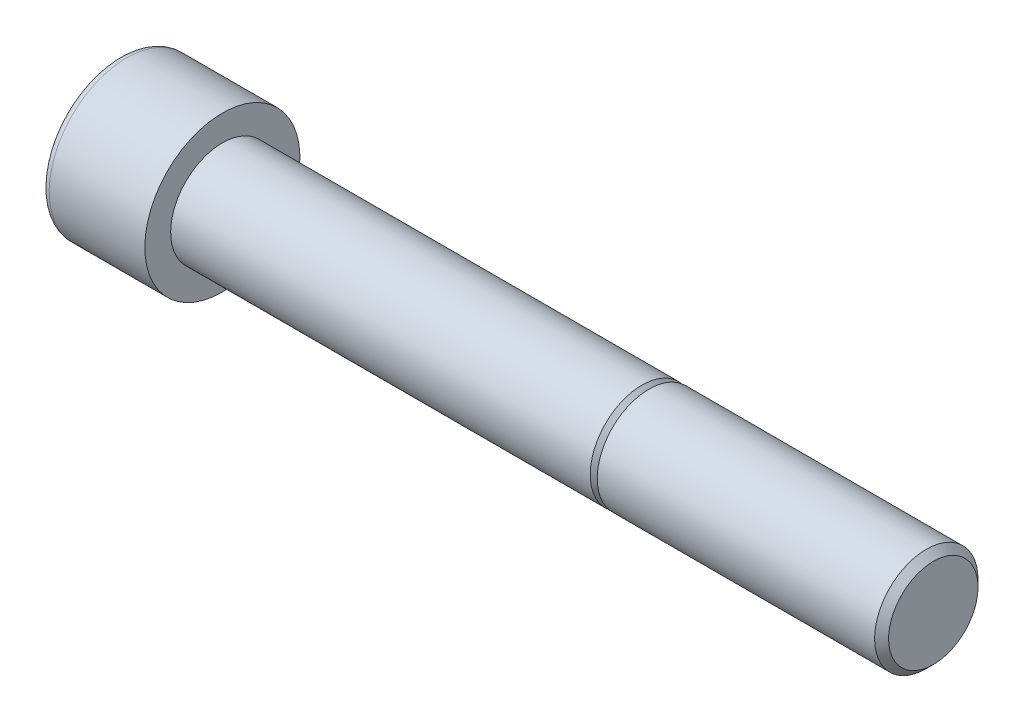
ISO-10303-21;
HEADER;
FILE_DESCRIPTION(('STEP AP214'),'2;1');
FILE_NAME('part.step','',(''),(''),'','','');
FILE_SCHEMA(('AUTOMOTIVE_DESIGN { 1 0 10303 214 1 1 1 1 }'));
ENDSEC;
DATA;
#1=APPLICATION_CONTEXT('core data for automotive mechanical design processes');
#2=APPLICATION_PROTOCOL_DEFINITION('international standard','automotive_design',2000,#1);
#3=PRODUCT_CONTEXT('',#1,'mechanical');
#4=PRODUCT('Part','Part','',(#3));
#5=PRODUCT_RELATED_PRODUCT_CATEGORY('part','',(#4));
#6=PRODUCT_DEFINITION_FORMATION('','',#4);
#7=PRODUCT_DEFINITION_CONTEXT('part definition',#1,'design');
#8=PRODUCT_DEFINITION('design','',#6,#7);
#9=PRODUCT_DEFINITION_SHAPE('','',#8);
#10=(LENGTH_UNIT() NAMED_UNIT(*) SI_UNIT(.MILLI.,.METRE.));
#11=(NAMED_UNIT(*) PLANE_ANGLE_UNIT() SI_UNIT($,.RADIAN.));
#12=(NAMED_UNIT(*) SI_UNIT($,.STERADIAN.) SOLID_ANGLE_UNIT());
#13=UNCERTAINTY_MEASURE_WITH_UNIT(LENGTH_MEASURE(1.E-05),#10,'distance_accuracy_value','');
#14=(GEOMETRIC_REPRESENTATION_CONTEXT(3) GLOBAL_UNCERTAINTY_ASSIGNED_CONTEXT((#13)) GLOBAL_UNIT_ASSIGNED_CONTEXT((#10,
#11,#12)) REPRESENTATION_CONTEXT('',''));
#15=CARTESIAN_POINT('',(0.,0.,0.));
#16=DIRECTION('',(0.,0.,1.));
#17=DIRECTION('',(1.,0.,0.));
#18=AXIS2_PLACEMENT_3D('',#15,#16,#17);
#19=CARTESIAN_POINT('',(80.,0.,0.));
#20=DIRECTION('',(-1.,0.,0.));
#21=DIRECTION('',(0.,-1.,0.));
#22=AXIS2_PLACEMENT_3D('',#19,#20,#21);
#23=CYLINDRICAL_SURFACE('',#22,8.);
#24=CARTESIAN_POINT('',(78.9175,0.,0.));
#25=DIRECTION('',(1.,0.,0.));
#26=DIRECTION('',(0.,1.,0.));
#27=AXIS2_PLACEMENT_3D('',#24,#25,#26);
#28=CIRCLE('',#27,8.);
#29=CARTESIAN_POINT('',(78.9175,8.,0.));
#30=VERTEX_POINT('',#29);
#31=EDGE_CURVE('E154',#30,#30,#28,.F.);
#32=ORIENTED_EDGE('',*,*,#31,.T.);
#33=EDGE_LOOP('',(#32));
#34=FACE_BOUND('',#33,.T.);
#35=CARTESIAN_POINT('',(36.,0.,0.));
#36=DIRECTION('',(-1.,0.,0.));
#37=DIRECTION('',(0.,-1.,0.));
#38=AXIS2_PLACEMENT_3D('',#35,#36,#37);
#39=CIRCLE('',#38,8.);
#40=CARTESIAN_POINT('',(36.,-8.,0.));
#41=VERTEX_POINT('',#40);
#42=EDGE_CURVE('E134',#41,#41,#39,.T.);
#43=ORIENTED_EDGE('',*,*,#42,.F.);
#44=EDGE_LOOP('',(#43));
#45=FACE_BOUND('',#44,.T.);
#46=ADVANCED_FACE('F32',(#34,#45),#23,.T.);
#47=CARTESIAN_POINT('',(80.,8.,0.));
#48=DIRECTION('',(1.,0.,0.));
#49=DIRECTION('',(0.,1.,0.));
#50=AXIS2_PLACEMENT_3D('',#47,#48,#49);
#51=PLANE('',#50);
#52=CARTESIAN_POINT('',(80.,0.,0.));
#53=DIRECTION('',(1.,0.,0.));
#54=DIRECTION('',(0.,1.,0.));
#55=AXIS2_PLACEMENT_3D('',#52,#53,#54);
#56=CIRCLE('',#55,6.91750000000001);
#57=CARTESIAN_POINT('',(80.,6.91750000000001,0.));
#58=VERTEX_POINT('',#57);
#59=EDGE_CURVE('E157',#58,#58,#56,.T.);
#60=ORIENTED_EDGE('',*,*,#59,.T.);
#61=EDGE_LOOP('',(#60));
#62=FACE_BOUND('',#61,.T.);
#63=ADVANCED_FACE('F174',(#62),#51,.T.);
#64=CARTESIAN_POINT('',(-46.,0.,0.));
#65=DIRECTION('',(-1.,0.,0.));
#66=DIRECTION('',(0.,-1.,0.));
#67=AXIS2_PLACEMENT_3D('',#64,#65,#66);
#68=PLANE('',#67);
#69=CARTESIAN_POINT('',(-46.,0.,0.));
#70=DIRECTION('',(-1.,0.,0.));
#71=DIRECTION('',(0.,-1.,0.));
#72=AXIS2_PLACEMENT_3D('',#69,#70,#71);
#73=CIRCLE('',#72,10.8);
#74=CARTESIAN_POINT('',(-46.,-10.8,0.));
#75=VERTEX_POINT('',#74);
#76=EDGE_CURVE('E40',#75,#75,#73,.T.);
#77=ORIENTED_EDGE('',*,*,#76,.T.);
#78=EDGE_LOOP('',(#77));
#79=FACE_BOUND('',#78,.T.);
#80=DIRECTION('',(0.,-1.,0.));
#81=VECTOR('',#80,1.);
#82=CARTESIAN_POINT('',(-46.,4.04145188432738,-7.));
#83=LINE('',#82,#81);
#84=CARTESIAN_POINT('',(-46.,4.04145188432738,-7.));
#85=VERTEX_POINT('',#84);
#86=CARTESIAN_POINT('',(-46.,-4.04145188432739,-7.));
#87=VERTEX_POINT('',#86);
#88=EDGE_CURVE('E47',#85,#87,#83,.T.);
#89=ORIENTED_EDGE('',*,*,#88,.F.);
#90=DIRECTION('',(0.,-0.5,-0.866025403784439));
#91=VECTOR('',#90,1.);
#92=CARTESIAN_POINT('',(-46.,8.08290376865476,0.));
#93=LINE('',#92,#91);
#94=CARTESIAN_POINT('',(-46.,8.08290376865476,0.));
#95=VERTEX_POINT('',#94);
#96=EDGE_CURVE('E130',#95,#85,#93,.T.);
#97=ORIENTED_EDGE('',*,*,#96,.F.);
#98=DIRECTION('',(0.,0.499999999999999,-0.866025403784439));
#99=VECTOR('',#98,1.);
#100=CARTESIAN_POINT('',(-46.,4.04145188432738,7.));
#101=LINE('',#100,#99);
#102=CARTESIAN_POINT('',(-46.,4.04145188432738,7.));
#103=VERTEX_POINT('',#102);
#104=EDGE_CURVE('E128',#103,#95,#101,.T.);
#105=ORIENTED_EDGE('',*,*,#104,.F.);
#106=DIRECTION('',(0.,1.,0.));
#107=VECTOR('',#106,1.);
#108=CARTESIAN_POINT('',(-46.,-4.04145188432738,7.));
#109=LINE('',#108,#107);
#110=CARTESIAN_POINT('',(-46.,-4.04145188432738,7.));
#111=VERTEX_POINT('',#110);
#112=EDGE_CURVE('E95',#111,#103,#109,.T.);
#113=ORIENTED_EDGE('',*,*,#112,.F.);
#114=DIRECTION('',(0.,0.5,0.866025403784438));
#115=VECTOR('',#114,1.);
#116=CARTESIAN_POINT('',(-46.,-8.08290376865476,0.));
#117=LINE('',#116,#115);
#118=CARTESIAN_POINT('',(-46.,-8.08290376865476,0.));
#119=VERTEX_POINT('',#118);
#120=EDGE_CURVE('E124',#119,#111,#117,.T.);
#121=ORIENTED_EDGE('',*,*,#120,.F.);
#122=DIRECTION('',(0.,-0.499999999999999,0.866025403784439));
#123=VECTOR('',#122,1.);
#124=CARTESIAN_POINT('',(-46.,-4.04145188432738,-7.));
#125=LINE('',#124,#123);
#126=EDGE_CURVE('E121',#87,#119,#125,.T.);
#127=ORIENTED_EDGE('',*,*,#126,.F.);
#128=EDGE_LOOP('',(#89,#97,#105,#113,#121,#127));
#129=FACE_BOUND('',#128,.T.);
#130=ADVANCED_FACE('F162',(#79,#129),#68,.T.);
#131=CARTESIAN_POINT('',(80.,0.,0.));
#132=DIRECTION('',(-1.,0.,0.));
#133=DIRECTION('',(0.,-1.,0.));
#134=AXIS2_PLACEMENT_3D('',#131,#132,#133);
#135=CYLINDRICAL_SURFACE('',#134,12.);
#136=CARTESIAN_POINT('',(-44.8,0.,0.));
#137=DIRECTION('',(-1.,0.,0.));
#138=DIRECTION('',(0.,-1.,0.));
#139=AXIS2_PLACEMENT_3D('',#136,#137,#138);
#140=CIRCLE('',#139,12.);
#141=CARTESIAN_POINT('',(-44.8,-12.,0.));
#142=VERTEX_POINT('',#141);
#143=EDGE_CURVE('E11',#142,#142,#140,.F.);
#144=ORIENTED_EDGE('',*,*,#143,.T.);
#145=EDGE_LOOP('',(#144));
#146=FACE_BOUND('',#145,.T.);
#147=CARTESIAN_POINT('',(-30.,0.,0.));
#148=DIRECTION('',(-1.,0.,0.));
#149=DIRECTION('',(0.,-1.,0.));
#150=AXIS2_PLACEMENT_3D('',#147,#148,#149);
#151=CIRCLE('',#150,12.);
#152=CARTESIAN_POINT('',(-30.,-12.,0.));
#153=VERTEX_POINT('',#152);
#154=EDGE_CURVE('E151',#153,#153,#151,.T.);
#155=ORIENTED_EDGE('',*,*,#154,.T.);
#156=EDGE_LOOP('',(#155));
#157=FACE_BOUND('',#156,.T.);
#158=ADVANCED_FACE('F186',(#146,#157),#135,.T.);
#159=CARTESIAN_POINT('',(-30.,12.,0.));
#160=DIRECTION('',(1.,0.,0.));
#161=DIRECTION('',(0.,1.,0.));
#162=AXIS2_PLACEMENT_3D('',#159,#160,#161);
#163=PLANE('',#162);
#164=CARTESIAN_POINT('',(-30.,0.,0.));
#165=DIRECTION('',(-1.,0.,0.));
#166=DIRECTION('',(0.,-1.,0.));
#167=AXIS2_PLACEMENT_3D('',#164,#165,#166);
#168=CIRCLE('',#167,8.00000000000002);
#169=CARTESIAN_POINT('',(-30.,-8.00000000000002,0.));
#170=VERTEX_POINT('',#169);
#171=EDGE_CURVE('E148',#170,#170,#168,.T.);
#172=ORIENTED_EDGE('',*,*,#171,.T.);
#173=EDGE_LOOP('',(#172));
#174=FACE_BOUND('',#173,.T.);
#175=ORIENTED_EDGE('',*,*,#154,.F.);
#176=EDGE_LOOP('',(#175));
#177=FACE_BOUND('',#176,.T.);
#178=ADVANCED_FACE('F189',(#174,#177),#163,.T.);
#179=CARTESIAN_POINT('',(80.,0.,0.));
#180=DIRECTION('',(-1.,0.,0.));
#181=DIRECTION('',(0.,-1.,0.));
#182=AXIS2_PLACEMENT_3D('',#179,#180,#181);
#183=CYLINDRICAL_SURFACE('',#182,8.00000000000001);
#184=CARTESIAN_POINT('',(34.9175,0.,0.));
#185=DIRECTION('',(-1.,0.,0.));
#186=DIRECTION('',(0.,-1.,0.));
#187=AXIS2_PLACEMENT_3D('',#184,#185,#186);
#188=CIRCLE('',#187,8.00000000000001);
#189=CARTESIAN_POINT('',(34.9175,-8.00000000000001,0.));
#190=VERTEX_POINT('',#189);
#191=EDGE_CURVE('E145',#190,#190,#188,.T.);
#192=ORIENTED_EDGE('',*,*,#191,.T.);
#193=EDGE_LOOP('',(#192));
#194=FACE_BOUND('',#193,.T.);
#195=ORIENTED_EDGE('',*,*,#171,.F.);
#196=EDGE_LOOP('',(#195));
#197=FACE_BOUND('',#196,.T.);
#198=ADVANCED_FACE('F193',(#194,#197),#183,.T.);
#199=CARTESIAN_POINT('',(34.9175,0.,0.));
#200=DIRECTION('',(-1.,0.,0.));
#201=DIRECTION('',(0.,-1.,0.));
#202=AXIS2_PLACEMENT_3D('',#199,#200,#201);
#203=CONICAL_SURFACE('',#202,8.00000000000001,0.785398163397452);
#204=CARTESIAN_POINT('',(36.,0.,0.));
#205=DIRECTION('',(-1.,0.,0.));
#206=DIRECTION('',(0.,-1.,0.));
#207=AXIS2_PLACEMENT_3D('',#204,#205,#206);
#208=CIRCLE('',#207,6.9175);
#209=CARTESIAN_POINT('',(36.,-6.9175,0.));
#210=VERTEX_POINT('',#209);
#211=EDGE_CURVE('E142',#210,#210,#208,.T.);
#212=ORIENTED_EDGE('',*,*,#211,.T.);
#213=EDGE_LOOP('',(#212));
#214=FACE_BOUND('',#213,.T.);
#215=ORIENTED_EDGE('',*,*,#191,.F.);
#216=EDGE_LOOP('',(#215));
#217=FACE_BOUND('',#216,.T.);
#218=ADVANCED_FACE('F197',(#214,#217),#203,.T.);
#219=CARTESIAN_POINT('',(36.,6.9175,0.));
#220=DIRECTION('',(-1.,0.,0.));
#221=DIRECTION('',(0.,-1.,0.));
#222=AXIS2_PLACEMENT_3D('',#219,#220,#221);
#223=PLANE('',#222);
#224=ORIENTED_EDGE('',*,*,#42,.T.);
#225=EDGE_LOOP('',(#224));
#226=FACE_BOUND('',#225,.T.);
#227=ORIENTED_EDGE('',*,*,#211,.F.);
#228=EDGE_LOOP('',(#227));
#229=FACE_BOUND('',#228,.T.);
#230=ADVANCED_FACE('F201',(#226,#229),#223,.T.);
#231=CARTESIAN_POINT('',(-38.,4.04145188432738,-7.));
#232=DIRECTION('',(0.,0.,-1.));
#233=DIRECTION('',(-1.,0.,0.));
#234=AXIS2_PLACEMENT_3D('',#231,#232,#233);
#235=PLANE('',#234);
#236=ORIENTED_EDGE('',*,*,#88,.T.);
#237=DIRECTION('',(-1.,0.,0.));
#238=VECTOR('',#237,1.);
#239=CARTESIAN_POINT('',(-38.,-4.04145188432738,-7.));
#240=LINE('',#239,#238);
#241=CARTESIAN_POINT('',(-38.,-4.04145188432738,-7.));
#242=VERTEX_POINT('',#241);
#243=EDGE_CURVE('E77',#242,#87,#240,.T.);
#244=ORIENTED_EDGE('',*,*,#243,.F.);
#245=DIRECTION('',(0.,-1.,0.));
#246=VECTOR('',#245,1.);
#247=CARTESIAN_POINT('',(-38.,4.04145188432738,-7.));
#248=LINE('',#247,#246);
#249=CARTESIAN_POINT('',(-38.,4.04145188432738,-7.));
#250=VERTEX_POINT('',#249);
#251=EDGE_CURVE('E132',#250,#242,#248,.T.);
#252=ORIENTED_EDGE('',*,*,#251,.F.);
#253=DIRECTION('',(-1.,0.,0.));
#254=VECTOR('',#253,1.);
#255=CARTESIAN_POINT('',(-38.,4.04145188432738,-7.));
#256=LINE('',#255,#254);
#257=EDGE_CURVE('E55',#250,#85,#256,.T.);
#258=ORIENTED_EDGE('',*,*,#257,.T.);
#259=EDGE_LOOP('',(#236,#244,#252,#258));
#260=FACE_BOUND('',#259,.T.);
#261=ADVANCED_FACE('F205',(#260),#235,.F.);
#262=CARTESIAN_POINT('',(-38.,8.08290376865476,0.));
#263=DIRECTION('',(0.,0.866025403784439,-0.5));
#264=DIRECTION('',(0.,0.5,0.866025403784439));
#265=AXIS2_PLACEMENT_3D('',#262,#263,#264);
#266=PLANE('',#265);
#267=ORIENTED_EDGE('',*,*,#96,.T.);
#268=ORIENTED_EDGE('',*,*,#257,.F.);
#269=DIRECTION('',(0.,-0.5,-0.866025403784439));
#270=VECTOR('',#269,1.);
#271=CARTESIAN_POINT('',(-38.,8.08290376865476,0.));
#272=LINE('',#271,#270);
#273=CARTESIAN_POINT('',(-38.,8.08290376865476,0.));
#274=VERTEX_POINT('',#273);
#275=EDGE_CURVE('E107',#274,#250,#272,.T.);
#276=ORIENTED_EDGE('',*,*,#275,.F.);
#277=DIRECTION('',(-1.,0.,0.));
#278=VECTOR('',#277,1.);
#279=CARTESIAN_POINT('',(-38.,8.08290376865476,0.));
#280=LINE('',#279,#278);
#281=EDGE_CURVE('E99',#274,#95,#280,.T.);
#282=ORIENTED_EDGE('',*,*,#281,.T.);
#283=EDGE_LOOP('',(#267,#268,#276,#282));
#284=FACE_BOUND('',#283,.T.);
#285=ADVANCED_FACE('F209',(#284),#266,.F.);
#286=CARTESIAN_POINT('',(-38.,4.04145188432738,7.));
#287=DIRECTION('',(0.,0.866025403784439,0.5));
#288=DIRECTION('',(0.,-0.499999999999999,0.866025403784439));
#289=AXIS2_PLACEMENT_3D('',#286,#287,#288);
#290=PLANE('',#289);
#291=ORIENTED_EDGE('',*,*,#104,.T.);
#292=ORIENTED_EDGE('',*,*,#281,.F.);
#293=DIRECTION('',(0.,0.499999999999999,-0.866025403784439));
#294=VECTOR('',#293,1.);
#295=CARTESIAN_POINT('',(-38.,4.04145188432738,7.));
#296=LINE('',#295,#294);
#297=CARTESIAN_POINT('',(-38.,4.04145188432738,7.));
#298=VERTEX_POINT('',#297);
#299=EDGE_CURVE('E103',#298,#274,#296,.T.);
#300=ORIENTED_EDGE('',*,*,#299,.F.);
#301=DIRECTION('',(-1.,0.,0.));
#302=VECTOR('',#301,1.);
#303=CARTESIAN_POINT('',(-38.,4.04145188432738,7.));
#304=LINE('',#303,#302);
#305=EDGE_CURVE('E88',#298,#103,#304,.T.);
#306=ORIENTED_EDGE('',*,*,#305,.T.);
#307=EDGE_LOOP('',(#291,#292,#300,#306));
#308=FACE_BOUND('',#307,.T.);
#309=ADVANCED_FACE('F104',(#308),#290,.F.);
#310=CARTESIAN_POINT('',(-38.,-4.04145188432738,7.));
#311=DIRECTION('',(0.,0.,1.));
#312=DIRECTION('',(1.,0.,0.));
#313=AXIS2_PLACEMENT_3D('',#310,#311,#312);
#314=PLANE('',#313);
#315=ORIENTED_EDGE('',*,*,#112,.T.);
#316=ORIENTED_EDGE('',*,*,#305,.F.);
#317=DIRECTION('',(0.,1.,0.));
#318=VECTOR('',#317,1.);
#319=CARTESIAN_POINT('',(-38.,-4.04145188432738,7.));
#320=LINE('',#319,#318);
#321=CARTESIAN_POINT('',(-38.,-4.04145188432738,7.));
#322=VERTEX_POINT('',#321);
#323=EDGE_CURVE('E92',#322,#298,#320,.T.);
#324=ORIENTED_EDGE('',*,*,#323,.F.);
#325=DIRECTION('',(-1.,0.,0.));
#326=VECTOR('',#325,1.);
#327=CARTESIAN_POINT('',(-38.,-4.04145188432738,7.));
#328=LINE('',#327,#326);
#329=EDGE_CURVE('E100',#322,#111,#328,.T.);
#330=ORIENTED_EDGE('',*,*,#329,.T.);
#331=EDGE_LOOP('',(#315,#316,#324,#330));
#332=FACE_BOUND('',#331,.T.);
#333=ADVANCED_FACE('F90',(#332),#314,.F.);
#334=CARTESIAN_POINT('',(-38.,-8.08290376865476,0.));
#335=DIRECTION('',(0.,-0.866025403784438,0.5));
#336=DIRECTION('',(0.,-0.5,-0.866025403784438));
#337=AXIS2_PLACEMENT_3D('',#334,#335,#336);
#338=PLANE('',#337);
#339=ORIENTED_EDGE('',*,*,#120,.T.);
#340=ORIENTED_EDGE('',*,*,#329,.F.);
#341=DIRECTION('',(0.,0.5,0.866025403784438));
#342=VECTOR('',#341,1.);
#343=CARTESIAN_POINT('',(-38.,-8.08290376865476,0.));
#344=LINE('',#343,#342);
#345=CARTESIAN_POINT('',(-38.,-8.08290376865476,0.));
#346=VERTEX_POINT('',#345);
#347=EDGE_CURVE('E113',#346,#322,#344,.T.);
#348=ORIENTED_EDGE('',*,*,#347,.F.);
#349=DIRECTION('',(-1.,0.,0.));
#350=VECTOR('',#349,1.);
#351=CARTESIAN_POINT('',(-38.,-8.08290376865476,0.));
#352=LINE('',#351,#350);
#353=EDGE_CURVE('E137',#346,#119,#352,.T.);
#354=ORIENTED_EDGE('',*,*,#353,.T.);
#355=EDGE_LOOP('',(#339,#340,#348,#354));
#356=FACE_BOUND('',#355,.T.);
#357=ADVANCED_FACE('F213',(#356),#338,.F.);
#358=CARTESIAN_POINT('',(-38.,-4.04145188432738,-7.));
#359=DIRECTION('',(0.,-0.866025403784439,-0.5));
#360=DIRECTION('',(0.,0.499999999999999,-0.866025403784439));
#361=AXIS2_PLACEMENT_3D('',#358,#359,#360);
#362=PLANE('',#361);
#363=ORIENTED_EDGE('',*,*,#126,.T.);
#364=ORIENTED_EDGE('',*,*,#353,.F.);
#365=DIRECTION('',(0.,-0.499999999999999,0.866025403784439));
#366=VECTOR('',#365,1.);
#367=CARTESIAN_POINT('',(-38.,-4.04145188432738,-7.));
#368=LINE('',#367,#366);
#369=EDGE_CURVE('E115',#242,#346,#368,.T.);
#370=ORIENTED_EDGE('',*,*,#369,.F.);
#371=ORIENTED_EDGE('',*,*,#243,.T.);
#372=EDGE_LOOP('',(#363,#364,#370,#371));
#373=FACE_BOUND('',#372,.T.);
#374=ADVANCED_FACE('F210',(#373),#362,.F.);
#375=CARTESIAN_POINT('',(-38.,-4.04145188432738,-7.));
#376=DIRECTION('',(-1.,0.,0.));
#377=DIRECTION('',(0.,0.,1.));
#378=AXIS2_PLACEMENT_3D('',#375,#376,#377);
#379=PLANE('',#378);
#380=ORIENTED_EDGE('',*,*,#251,.T.);
#381=ORIENTED_EDGE('',*,*,#369,.T.);
#382=ORIENTED_EDGE('',*,*,#347,.T.);
#383=ORIENTED_EDGE('',*,*,#323,.T.);
#384=ORIENTED_EDGE('',*,*,#299,.T.);
#385=ORIENTED_EDGE('',*,*,#275,.T.);
#386=EDGE_LOOP('',(#380,#381,#382,#383,#384,#385));
#387=FACE_BOUND('',#386,.T.);
#388=ADVANCED_FACE('F110',(#387),#379,.T.);
#389=CARTESIAN_POINT('',(78.9175,0.,0.));
#390=DIRECTION('',(-1.,0.,0.));
#391=DIRECTION('',(0.,-1.,0.));
#392=AXIS2_PLACEMENT_3D('',#389,#390,#391);
#393=CONICAL_SURFACE('',#392,8.,0.785398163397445);
#394=ORIENTED_EDGE('',*,*,#59,.F.);
#395=EDGE_LOOP('',(#394));
#396=FACE_BOUND('',#395,.T.);
#397=ORIENTED_EDGE('',*,*,#31,.F.);
#398=EDGE_LOOP('',(#397));
#399=FACE_BOUND('',#398,.T.);
#400=ADVANCED_FACE('F166',(#396,#399),#393,.T.);
#401=CARTESIAN_POINT('',(-44.8,0.,0.));
#402=DIRECTION('',(-1.,0.,0.));
#403=DIRECTION('',(0.,-1.,0.));
#404=AXIS2_PLACEMENT_3D('',#401,#402,#403);
#405=TOROIDAL_SURFACE('',#404,10.8,1.2);
#406=ORIENTED_EDGE('',*,*,#143,.F.);
#407=EDGE_LOOP('',(#406));
#408=FACE_BOUND('',#407,.T.);
#409=ORIENTED_EDGE('',*,*,#76,.F.);
#410=EDGE_LOOP('',(#409));
#411=FACE_BOUND('',#410,.T.);
#412=ADVANCED_FACE('F34',(#408,#411),#405,.T.);
#413=CLOSED_SHELL('',(#46,#63,#130,#158,#178,#198,#218,#230,#261,#285,#309,#333,#357,#374,#388,
#400,#412));
#414=MANIFOLD_SOLID_BREP('B2',#413);
#415=ADVANCED_BREP_SHAPE_REPRESENTATION('',(#18,#414),#14);
#416=SHAPE_DEFINITION_REPRESENTATION(#9,#415);
ENDSEC;
END-ISO-10303-21;
